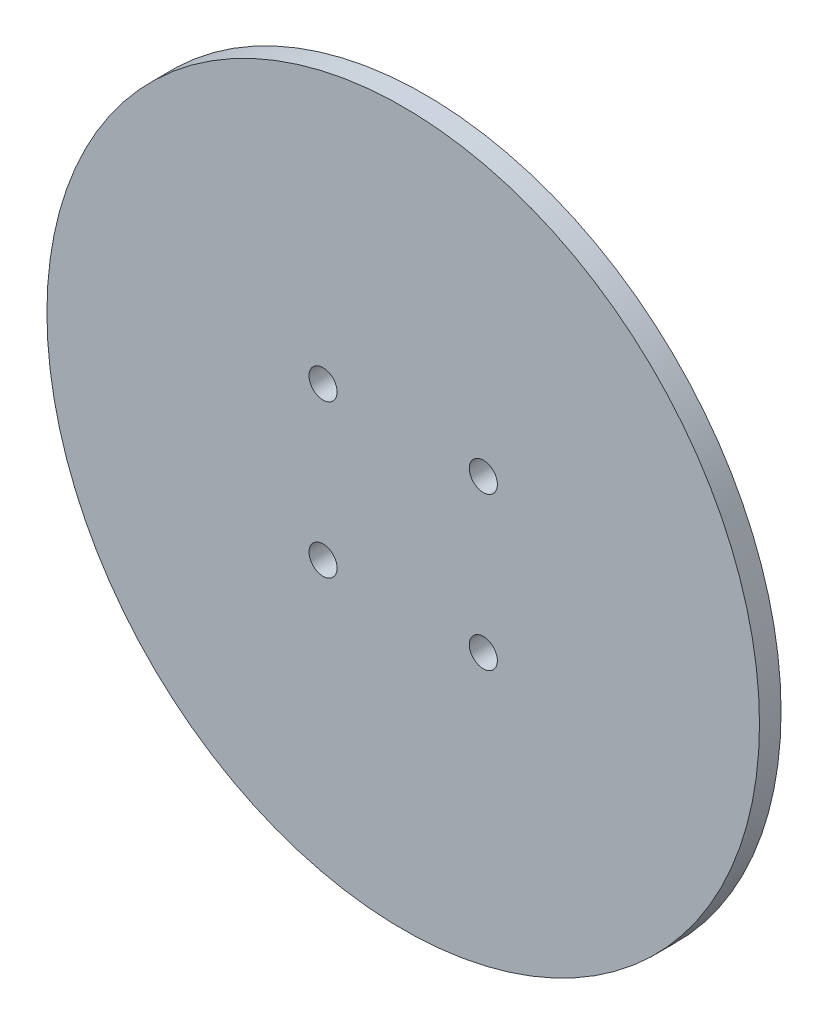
from build123d import *

# Parameters (mm, degrees)
SKETCH_1_R          = 66
EXTRUDE_3_DEPTH     = 4
SKETCH_15_R         = 2.6
CUT_EXTRUDE_1_DEPTH = 94.423765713


with BuildPart() as part:
    # Sketch 1 → Extrude 3 (new body)
    with BuildSketch(Plane.XY):
        Circle(SKETCH_1_R)
    extrude(amount=EXTRUDE_3_DEPTH)

    # Sketch 15 → Cut-Extrude 1 (cut, through all)
    with BuildSketch(Plane(origin=(0, 0, 0), x_dir=(-1, 0, 0), z_dir=(0, 0, -1))):
        with Locations((-14.845865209, 14.13684145)):
            Circle(SKETCH_15_R)
        with Locations((14.845865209, 14.13684145)):
            Circle(SKETCH_15_R)
        with Locations((14.845865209, -14.13684145)):
            Circle(SKETCH_15_R)
        with Locations((-14.845865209, -14.13684145)):
            Circle(SKETCH_15_R)
    extrude(amount=-CUT_EXTRUDE_1_DEPTH, mode=Mode.SUBTRACT)


solid = part.part
